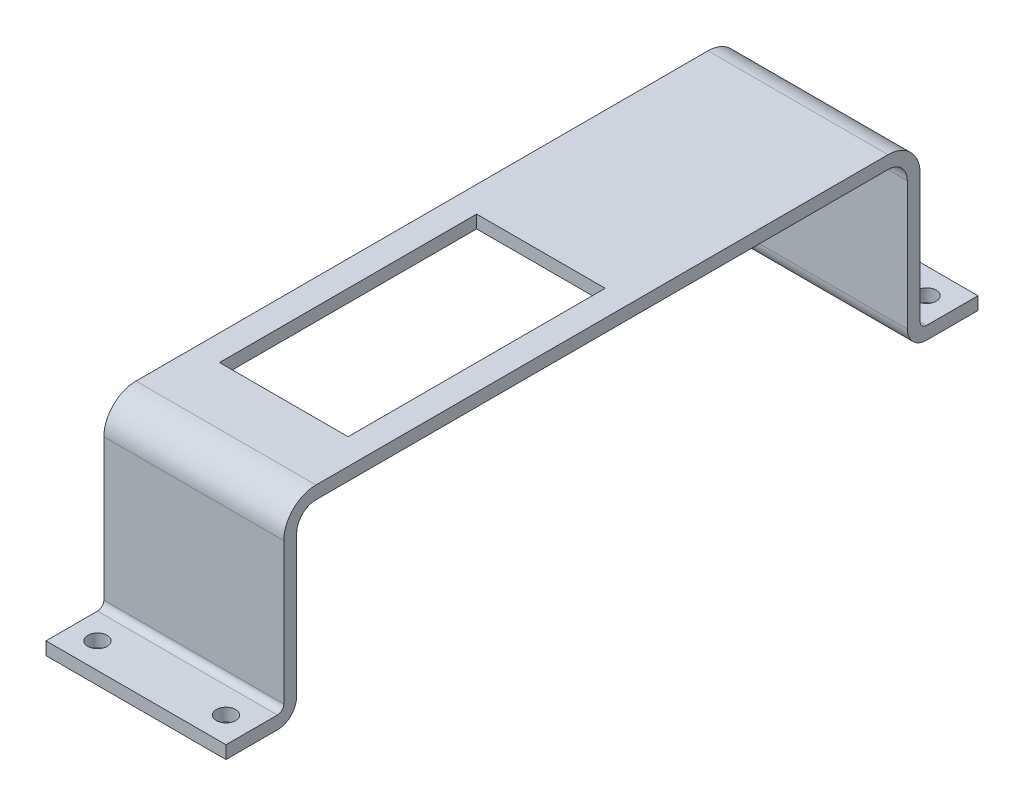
from build123d import *

# Parameters (mm, degrees)
BOSS_EXTRUDE1_DEPTH = 14
SKETCH2_W           = 20
SKETCH2_H           = 40
CUT_EXTRUDE1_DEPTH  = 112.049538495
SKETCH3_R           = 1.5
CUT_EXTRUDE2_DEPTH  = 111.526015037
SKETCH4_R           = 1.5
CUT_EXTRUDE3_DEPTH  = 111.036357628


with BuildPart() as part:
    # Sketch1 → Boss-Extrude1 (new, symmetric)
    with BuildSketch(Plane(origin=(0, 0, 0), x_dir=(0, 0, -1), z_dir=(1, 0, 0))):
        with BuildLine():
            Line((3, 0), (11, 0))
            Line((11, 0), (11, 2))
            Line((11, 2), (3, 2))
            ThreePointArc((3, 2), (2.292893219, 2.292893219), (2, 3))
            Line((2, 3), (2, 23))
            ThreePointArc((2, 23), (0.535533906, 26.535533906), (-3, 28))
            Line((-3, 28), (-92, 28))
            ThreePointArc((-92, 28), (-95.535533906, 26.535533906), (-97, 23))
            Line((-97, 23), (-97, 1))
            ThreePointArc((-97, 1), (-97.292893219, 0.292893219), (-98, 0))
            Line((-98, 0), (-106, 0))
            Line((-106, 0), (-106, -2))
            Line((-106, -2), (-98, -2))
            ThreePointArc((-98, -2), (-95.878679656, -1.121320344), (-95, 1))
            Line((-95, 1), (-95, 23))
            ThreePointArc((-95, 23), (-94.121320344, 25.121320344), (-92, 26))
            Line((-92, 26), (-3, 26))
            ThreePointArc((-3, 26), (-0.878679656, 25.121320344), (0, 23))
            Line((0, 23), (0, 3))
            ThreePointArc((0, 3), (0.878679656, 0.878679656), (3, 0))
        make_face()
    extrude(amount=BOSS_EXTRUDE1_DEPTH, both=True)

    # Sketch2 → Cut-Extrude1 (cut, through all)
    with BuildSketch(Plane(origin=(0, 28, 0), x_dir=(1, 0, 0), z_dir=(0, 1, 0))):
        with Locations((0, -63)):
            Rectangle(SKETCH2_W, SKETCH2_H)
    extrude(amount=-CUT_EXTRUDE1_DEPTH, mode=Mode.SUBTRACT)

    # Sketch3 → Cut-Extrude2 (cut, through all)
    with BuildSketch(Plane(origin=(0, 0, 0), x_dir=(1, 0, 0), z_dir=(0, 1, 0))):
        with Locations(Location((10, -102, 0), (0, 0, 270))):
            Circle(SKETCH3_R)
        with Locations(Location((-10, -102, 0), (0, 0, 270))):
            Circle(SKETCH3_R)
    extrude(amount=-CUT_EXTRUDE2_DEPTH, mode=Mode.SUBTRACT)

    # Sketch4 → Cut-Extrude3 (cut, through all)
    with BuildSketch(Plane(origin=(0, 2, 0), x_dir=(1, 0, 0), z_dir=(0, 1, 0))):
        with Locations(Location((10, 7, 0), (0, 0, 270))):
            Circle(SKETCH4_R)
        with Locations(Location((-10, 7, 0), (0, 0, 270))):
            Circle(SKETCH4_R)
    extrude(amount=-CUT_EXTRUDE3_DEPTH, mode=Mode.SUBTRACT)


solid = part.part
